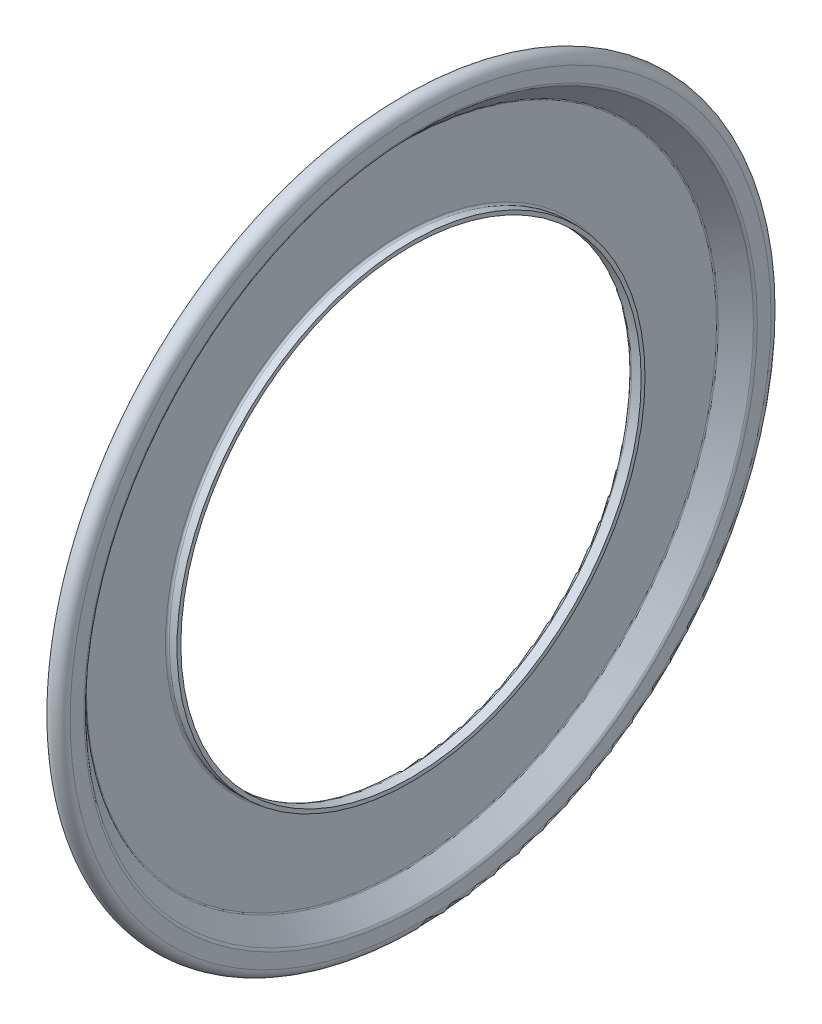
ISO-10303-21;
HEADER;
FILE_DESCRIPTION(('STEP AP214'),'2;1');
FILE_NAME('part.step','',(''),(''),'','','');
FILE_SCHEMA(('AUTOMOTIVE_DESIGN { 1 0 10303 214 1 1 1 1 }'));
ENDSEC;
DATA;
#1=APPLICATION_CONTEXT('core data for automotive mechanical design processes');
#2=APPLICATION_PROTOCOL_DEFINITION('international standard','automotive_design',2000,#1);
#3=PRODUCT_CONTEXT('',#1,'mechanical');
#4=PRODUCT('Part','Part','',(#3));
#5=PRODUCT_RELATED_PRODUCT_CATEGORY('part','',(#4));
#6=PRODUCT_DEFINITION_FORMATION('','',#4);
#7=PRODUCT_DEFINITION_CONTEXT('part definition',#1,'design');
#8=PRODUCT_DEFINITION('design','',#6,#7);
#9=PRODUCT_DEFINITION_SHAPE('','',#8);
#10=(LENGTH_UNIT() NAMED_UNIT(*) SI_UNIT(.MILLI.,.METRE.));
#11=(NAMED_UNIT(*) PLANE_ANGLE_UNIT() SI_UNIT($,.RADIAN.));
#12=(NAMED_UNIT(*) SI_UNIT($,.STERADIAN.) SOLID_ANGLE_UNIT());
#13=UNCERTAINTY_MEASURE_WITH_UNIT(LENGTH_MEASURE(1.E-05),#10,'distance_accuracy_value','');
#14=(GEOMETRIC_REPRESENTATION_CONTEXT(3) GLOBAL_UNCERTAINTY_ASSIGNED_CONTEXT((#13)) GLOBAL_UNIT_ASSIGNED_CONTEXT((#10,
#11,#12)) REPRESENTATION_CONTEXT('',''));
#15=CARTESIAN_POINT('',(0.,0.,0.));
#16=DIRECTION('',(0.,0.,1.));
#17=DIRECTION('',(1.,0.,0.));
#18=AXIS2_PLACEMENT_3D('',#15,#16,#17);
#19=CARTESIAN_POINT('',(0.36,9.8496,0.));
#20=DIRECTION('',(-1.,0.,0.));
#21=DIRECTION('',(0.,0.,1.));
#22=AXIS2_PLACEMENT_3D('',#19,#20,#21);
#23=PLANE('',#22);
#24=CARTESIAN_POINT('',(0.36,0.,0.));
#25=DIRECTION('',(1.,0.,0.));
#26=DIRECTION('',(0.,0.,-1.));
#27=AXIS2_PLACEMENT_3D('',#24,#25,#26);
#28=CIRCLE('',#27,7.2975);
#29=CARTESIAN_POINT('',(0.36,0.,-7.2975));
#30=VERTEX_POINT('',#29);
#31=EDGE_CURVE('E79',#30,#30,#28,.T.);
#32=ORIENTED_EDGE('',*,*,#31,.T.);
#33=EDGE_LOOP('',(#32));
#34=FACE_BOUND('',#33,.T.);
#35=CARTESIAN_POINT('',(0.36,0.,0.));
#36=DIRECTION('',(1.,0.,0.));
#37=DIRECTION('',(0.,0.,-1.));
#38=AXIS2_PLACEMENT_3D('',#35,#36,#37);
#39=CIRCLE('',#38,9.8496);
#40=CARTESIAN_POINT('',(0.36,0.,-9.8496));
#41=VERTEX_POINT('',#40);
#42=EDGE_CURVE('E76',#41,#41,#39,.T.);
#43=ORIENTED_EDGE('',*,*,#42,.F.);
#44=EDGE_LOOP('',(#43));
#45=FACE_BOUND('',#44,.T.);
#46=ADVANCED_FACE('F14',(#34,#45),#23,.T.);
#47=CARTESIAN_POINT('',(0.479999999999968,0.,0.));
#48=DIRECTION('',(1.,0.,0.));
#49=DIRECTION('',(0.,0.,-1.));
#50=AXIS2_PLACEMENT_3D('',#47,#48,#49);
#51=TOROIDAL_SURFACE('',#50,7.2975,0.119999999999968);
#52=CARTESIAN_POINT('',(0.48,0.,0.));
#53=DIRECTION('',(1.,0.,0.));
#54=DIRECTION('',(0.,0.,-1.));
#55=AXIS2_PLACEMENT_3D('',#52,#53,#54);
#56=CIRCLE('',#55,7.1775);
#57=CARTESIAN_POINT('',(0.48,0.,-7.1775));
#58=VERTEX_POINT('',#57);
#59=EDGE_CURVE('E73',#58,#58,#56,.T.);
#60=ORIENTED_EDGE('',*,*,#59,.T.);
#61=EDGE_LOOP('',(#60));
#62=FACE_BOUND('',#61,.T.);
#63=ORIENTED_EDGE('',*,*,#31,.F.);
#64=EDGE_LOOP('',(#63));
#65=FACE_BOUND('',#64,.T.);
#66=ADVANCED_FACE('F85',(#62,#65),#51,.T.);
#67=CARTESIAN_POINT('',(6.,0.,0.));
#68=DIRECTION('',(1.,0.,0.));
#69=DIRECTION('',(0.,0.,-1.));
#70=AXIS2_PLACEMENT_3D('',#67,#68,#69);
#71=CYLINDRICAL_SURFACE('',#70,7.1775);
#72=CARTESIAN_POINT('',(0.78,0.,0.));
#73=DIRECTION('',(1.,0.,0.));
#74=DIRECTION('',(0.,0.,-1.));
#75=AXIS2_PLACEMENT_3D('',#72,#73,#74);
#76=CIRCLE('',#75,7.1775);
#77=CARTESIAN_POINT('',(0.78,0.,-7.1775));
#78=VERTEX_POINT('',#77);
#79=EDGE_CURVE('E70',#78,#78,#76,.T.);
#80=ORIENTED_EDGE('',*,*,#79,.T.);
#81=EDGE_LOOP('',(#80));
#82=FACE_BOUND('',#81,.T.);
#83=ORIENTED_EDGE('',*,*,#59,.F.);
#84=EDGE_LOOP('',(#83));
#85=FACE_BOUND('',#84,.T.);
#86=ADVANCED_FACE('F87',(#82,#85),#71,.F.);
#87=CARTESIAN_POINT('',(0.78,7.1775,0.));
#88=DIRECTION('',(1.,0.,0.));
#89=DIRECTION('',(0.,0.,-1.));
#90=AXIS2_PLACEMENT_3D('',#87,#88,#89);
#91=PLANE('',#90);
#92=CARTESIAN_POINT('',(0.78,0.,0.));
#93=DIRECTION('',(1.,0.,0.));
#94=DIRECTION('',(0.,0.,-1.));
#95=AXIS2_PLACEMENT_3D('',#92,#93,#94);
#96=CIRCLE('',#95,7.2975);
#97=CARTESIAN_POINT('',(0.78,0.,-7.2975));
#98=VERTEX_POINT('',#97);
#99=EDGE_CURVE('E67',#98,#98,#96,.T.);
#100=ORIENTED_EDGE('',*,*,#99,.T.);
#101=EDGE_LOOP('',(#100));
#102=FACE_BOUND('',#101,.T.);
#103=ORIENTED_EDGE('',*,*,#79,.F.);
#104=EDGE_LOOP('',(#103));
#105=FACE_BOUND('',#104,.T.);
#106=ADVANCED_FACE('F95',(#102,#105),#91,.T.);
#107=CARTESIAN_POINT('',(6.,0.,0.));
#108=DIRECTION('',(1.,0.,0.));
#109=DIRECTION('',(0.,0.,-1.));
#110=AXIS2_PLACEMENT_3D('',#107,#108,#109);
#111=CYLINDRICAL_SURFACE('',#110,7.2975);
#112=CARTESIAN_POINT('',(0.54,0.,0.));
#113=DIRECTION('',(1.,0.,0.));
#114=DIRECTION('',(0.,0.,-1.));
#115=AXIS2_PLACEMENT_3D('',#112,#113,#114);
#116=CIRCLE('',#115,7.2975);
#117=CARTESIAN_POINT('',(0.54,0.,-7.2975));
#118=VERTEX_POINT('',#117);
#119=EDGE_CURVE('E64',#118,#118,#116,.T.);
#120=ORIENTED_EDGE('',*,*,#119,.T.);
#121=EDGE_LOOP('',(#120));
#122=FACE_BOUND('',#121,.T.);
#123=ORIENTED_EDGE('',*,*,#99,.F.);
#124=EDGE_LOOP('',(#123));
#125=FACE_BOUND('',#124,.T.);
#126=ADVANCED_FACE('F102',(#122,#125),#111,.T.);
#127=CARTESIAN_POINT('',(0.539999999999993,0.,0.));
#128=DIRECTION('',(1.,0.,0.));
#129=DIRECTION('',(0.,0.,-1.));
#130=AXIS2_PLACEMENT_3D('',#127,#128,#129);
#131=TOROIDAL_SURFACE('',#130,7.3575,0.0599999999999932);
#132=ORIENTED_EDGE('',*,*,#119,.F.);
#133=EDGE_LOOP('',(#132));
#134=FACE_BOUND('',#133,.T.);
#135=CARTESIAN_POINT('',(0.48,0.,0.));
#136=DIRECTION('',(1.,0.,0.));
#137=DIRECTION('',(0.,0.,-1.));
#138=AXIS2_PLACEMENT_3D('',#135,#136,#137);
#139=CIRCLE('',#138,7.35749999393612);
#140=CARTESIAN_POINT('',(0.48,0.,-7.35749999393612));
#141=VERTEX_POINT('',#140);
#142=EDGE_CURVE('E61',#141,#141,#139,.T.);
#143=ORIENTED_EDGE('',*,*,#142,.T.);
#144=EDGE_LOOP('',(#143));
#145=FACE_BOUND('',#144,.T.);
#146=ADVANCED_FACE('F106',(#134,#145),#131,.F.);
#147=CARTESIAN_POINT('',(0.48,7.3575,0.));
#148=DIRECTION('',(1.,0.,0.));
#149=DIRECTION('',(0.,0.,-1.));
#150=AXIS2_PLACEMENT_3D('',#147,#148,#149);
#151=PLANE('',#150);
#152=CARTESIAN_POINT('',(0.48,0.,0.));
#153=DIRECTION('',(1.,0.,0.));
#154=DIRECTION('',(0.,0.,-1.));
#155=AXIS2_PLACEMENT_3D('',#152,#153,#154);
#156=CIRCLE('',#155,9.8247471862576);
#157=CARTESIAN_POINT('',(0.48,0.,-9.8247471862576));
#158=VERTEX_POINT('',#157);
#159=EDGE_CURVE('E58',#158,#158,#156,.T.);
#160=ORIENTED_EDGE('',*,*,#159,.T.);
#161=EDGE_LOOP('',(#160));
#162=FACE_BOUND('',#161,.T.);
#163=ORIENTED_EDGE('',*,*,#142,.F.);
#164=EDGE_LOOP('',(#163));
#165=FACE_BOUND('',#164,.T.);
#166=ADVANCED_FACE('F110',(#162,#165),#151,.T.);
#167=CARTESIAN_POINT('',(0.540000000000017,0.,0.));
#168=DIRECTION('',(1.,0.,0.));
#169=DIRECTION('',(0.,0.,-1.));
#170=AXIS2_PLACEMENT_3D('',#167,#168,#169);
#171=TOROIDAL_SURFACE('',#170,9.8247471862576,0.0600000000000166);
#172=ORIENTED_EDGE('',*,*,#159,.F.);
#173=EDGE_LOOP('',(#172));
#174=FACE_BOUND('',#173,.T.);
#175=CARTESIAN_POINT('',(0.49757359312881,0.,0.));
#176=DIRECTION('',(1.,0.,0.));
#177=DIRECTION('',(0.,0.,-1.));
#178=AXIS2_PLACEMENT_3D('',#175,#176,#177);
#179=CIRCLE('',#178,9.8671735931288);
#180=CARTESIAN_POINT('',(0.49757359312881,0.,-9.8671735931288));
#181=VERTEX_POINT('',#180);
#182=EDGE_CURVE('E55',#181,#181,#179,.T.);
#183=ORIENTED_EDGE('',*,*,#182,.T.);
#184=EDGE_LOOP('',(#183));
#185=FACE_BOUND('',#184,.T.);
#186=ADVANCED_FACE('F114',(#174,#185),#171,.F.);
#187=CARTESIAN_POINT('',(0.49757359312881,0.,0.));
#188=DIRECTION('',(1.,0.,0.));
#189=DIRECTION('',(0.,0.,-1.));
#190=AXIS2_PLACEMENT_3D('',#187,#188,#189);
#191=CONICAL_SURFACE('',#190,9.8671735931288,0.785398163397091);
#192=CARTESIAN_POINT('',(1.0448528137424,0.,0.));
#193=DIRECTION('',(1.,0.,0.));
#194=DIRECTION('',(0.,0.,-1.));
#195=AXIS2_PLACEMENT_3D('',#192,#193,#194);
#196=CIRCLE('',#195,10.414452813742);
#197=CARTESIAN_POINT('',(1.0448528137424,0.,-10.414452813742));
#198=VERTEX_POINT('',#197);
#199=EDGE_CURVE('E52',#198,#198,#196,.T.);
#200=ORIENTED_EDGE('',*,*,#199,.T.);
#201=EDGE_LOOP('',(#200));
#202=FACE_BOUND('',#201,.T.);
#203=ORIENTED_EDGE('',*,*,#182,.F.);
#204=EDGE_LOOP('',(#203));
#205=FACE_BOUND('',#204,.T.);
#206=ADVANCED_FACE('F118',(#202,#205),#191,.F.);
#207=CARTESIAN_POINT('',(0.959999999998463,0.,0.));
#208=DIRECTION('',(1.,0.,0.));
#209=DIRECTION('',(0.,0.,-1.));
#210=AXIS2_PLACEMENT_3D('',#207,#208,#209);
#211=TOROIDAL_SURFACE('',#210,10.499305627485,0.120000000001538);
#212=CARTESIAN_POINT('',(1.08,0.,0.));
#213=DIRECTION('',(1.,0.,0.));
#214=DIRECTION('',(0.,0.,-1.));
#215=AXIS2_PLACEMENT_3D('',#212,#213,#214);
#216=CIRCLE('',#215,10.4993056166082);
#217=CARTESIAN_POINT('',(1.08,0.,-10.4993056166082));
#218=VERTEX_POINT('',#217);
#219=EDGE_CURVE('E49',#218,#218,#216,.T.);
#220=ORIENTED_EDGE('',*,*,#219,.T.);
#221=EDGE_LOOP('',(#220));
#222=FACE_BOUND('',#221,.T.);
#223=ORIENTED_EDGE('',*,*,#199,.F.);
#224=EDGE_LOOP('',(#223));
#225=FACE_BOUND('',#224,.T.);
#226=ADVANCED_FACE('F122',(#222,#225),#211,.T.);
#227=CARTESIAN_POINT('',(1.08,10.499305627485,0.));
#228=DIRECTION('',(1.,0.,0.));
#229=DIRECTION('',(0.,0.,-1.));
#230=AXIS2_PLACEMENT_3D('',#227,#228,#229);
#231=PLANE('',#230);
#232=CARTESIAN_POINT('',(1.08,0.,0.));
#233=DIRECTION('',(1.,0.,0.));
#234=DIRECTION('',(0.,0.,-1.));
#235=AXIS2_PLACEMENT_3D('',#232,#233,#234);
#236=CIRCLE('',#235,10.9296);
#237=CARTESIAN_POINT('',(1.08,0.,-10.9296));
#238=VERTEX_POINT('',#237);
#239=EDGE_CURVE('E46',#238,#238,#236,.T.);
#240=ORIENTED_EDGE('',*,*,#239,.T.);
#241=EDGE_LOOP('',(#240));
#242=FACE_BOUND('',#241,.T.);
#243=ORIENTED_EDGE('',*,*,#219,.F.);
#244=EDGE_LOOP('',(#243));
#245=FACE_BOUND('',#244,.T.);
#246=ADVANCED_FACE('F126',(#242,#245),#231,.T.);
#247=CARTESIAN_POINT('',(0.77999999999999,0.,0.));
#248=DIRECTION('',(1.,0.,0.));
#249=DIRECTION('',(0.,0.,-1.));
#250=AXIS2_PLACEMENT_3D('',#247,#248,#249);
#251=TOROIDAL_SURFACE('',#250,10.9296,0.30000000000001);
#252=CARTESIAN_POINT('',(0.78,0.,0.));
#253=DIRECTION('',(1.,0.,0.));
#254=DIRECTION('',(0.,0.,-1.));
#255=AXIS2_PLACEMENT_3D('',#252,#253,#254);
#256=CIRCLE('',#255,10.6296);
#257=CARTESIAN_POINT('',(0.78,0.,-10.6296));
#258=VERTEX_POINT('',#257);
#259=EDGE_CURVE('E43',#258,#258,#256,.T.);
#260=ORIENTED_EDGE('',*,*,#259,.T.);
#261=EDGE_LOOP('',(#260));
#262=FACE_BOUND('',#261,.T.);
#263=ORIENTED_EDGE('',*,*,#239,.F.);
#264=EDGE_LOOP('',(#263));
#265=FACE_BOUND('',#264,.T.);
#266=ADVANCED_FACE('F130',(#262,#265),#251,.T.);
#267=CARTESIAN_POINT('',(6.,0.,0.));
#268=DIRECTION('',(1.,0.,0.));
#269=DIRECTION('',(0.,0.,-1.));
#270=AXIS2_PLACEMENT_3D('',#267,#268,#269);
#271=CYLINDRICAL_SURFACE('',#270,10.6296);
#272=CARTESIAN_POINT('',(0.84,0.,0.));
#273=DIRECTION('',(1.,0.,0.));
#274=DIRECTION('',(0.,0.,-1.));
#275=AXIS2_PLACEMENT_3D('',#272,#273,#274);
#276=CIRCLE('',#275,10.6296);
#277=CARTESIAN_POINT('',(0.84,0.,-10.6296));
#278=VERTEX_POINT('',#277);
#279=EDGE_CURVE('E40',#278,#278,#276,.T.);
#280=ORIENTED_EDGE('',*,*,#279,.T.);
#281=EDGE_LOOP('',(#280));
#282=FACE_BOUND('',#281,.T.);
#283=ORIENTED_EDGE('',*,*,#259,.F.);
#284=EDGE_LOOP('',(#283));
#285=FACE_BOUND('',#284,.T.);
#286=ADVANCED_FACE('F134',(#282,#285),#271,.F.);
#287=CARTESIAN_POINT('',(0.84,10.6296,0.));
#288=DIRECTION('',(1.,0.,0.));
#289=DIRECTION('',(0.,0.,-1.));
#290=AXIS2_PLACEMENT_3D('',#287,#288,#289);
#291=PLANE('',#290);
#292=CARTESIAN_POINT('',(0.84,0.,0.));
#293=DIRECTION('',(1.,0.,0.));
#294=DIRECTION('',(0.,0.,-1.));
#295=AXIS2_PLACEMENT_3D('',#292,#293,#294);
#296=CIRCLE('',#295,10.7496);
#297=CARTESIAN_POINT('',(0.84,0.,-10.7496));
#298=VERTEX_POINT('',#297);
#299=EDGE_CURVE('E37',#298,#298,#296,.T.);
#300=ORIENTED_EDGE('',*,*,#299,.T.);
#301=EDGE_LOOP('',(#300));
#302=FACE_BOUND('',#301,.T.);
#303=ORIENTED_EDGE('',*,*,#279,.F.);
#304=EDGE_LOOP('',(#303));
#305=FACE_BOUND('',#304,.T.);
#306=ADVANCED_FACE('F138',(#302,#305),#291,.T.);
#307=CARTESIAN_POINT('',(6.,0.,0.));
#308=DIRECTION('',(1.,0.,0.));
#309=DIRECTION('',(0.,0.,-1.));
#310=AXIS2_PLACEMENT_3D('',#307,#308,#309);
#311=CYLINDRICAL_SURFACE('',#310,10.7496);
#312=CARTESIAN_POINT('',(0.78,0.,0.));
#313=DIRECTION('',(1.,0.,0.));
#314=DIRECTION('',(0.,0.,-1.));
#315=AXIS2_PLACEMENT_3D('',#312,#313,#314);
#316=CIRCLE('',#315,10.7496);
#317=CARTESIAN_POINT('',(0.78,0.,-10.7496));
#318=VERTEX_POINT('',#317);
#319=EDGE_CURVE('E34',#318,#318,#316,.T.);
#320=ORIENTED_EDGE('',*,*,#319,.T.);
#321=EDGE_LOOP('',(#320));
#322=FACE_BOUND('',#321,.T.);
#323=ORIENTED_EDGE('',*,*,#299,.F.);
#324=EDGE_LOOP('',(#323));
#325=FACE_BOUND('',#324,.T.);
#326=ADVANCED_FACE('F142',(#322,#325),#311,.T.);
#327=CARTESIAN_POINT('',(0.779999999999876,0.,0.));
#328=DIRECTION('',(1.,0.,0.));
#329=DIRECTION('',(0.,0.,-1.));
#330=AXIS2_PLACEMENT_3D('',#327,#328,#329);
#331=TOROIDAL_SURFACE('',#330,10.9296000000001,0.180000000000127);
#332=ORIENTED_EDGE('',*,*,#319,.F.);
#333=EDGE_LOOP('',(#332));
#334=FACE_BOUND('',#333,.T.);
#335=CARTESIAN_POINT('',(0.96,0.,0.));
#336=DIRECTION('',(1.,0.,0.));
#337=DIRECTION('',(0.,0.,-1.));
#338=AXIS2_PLACEMENT_3D('',#335,#336,#337);
#339=CIRCLE('',#338,10.9295999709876);
#340=CARTESIAN_POINT('',(0.96,0.,-10.9295999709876));
#341=VERTEX_POINT('',#340);
#342=EDGE_CURVE('E29',#341,#341,#339,.T.);
#343=ORIENTED_EDGE('',*,*,#342,.T.);
#344=EDGE_LOOP('',(#343));
#345=FACE_BOUND('',#344,.T.);
#346=ADVANCED_FACE('F146',(#334,#345),#331,.F.);
#347=CARTESIAN_POINT('',(0.96,10.9296,0.));
#348=DIRECTION('',(-1.,0.,0.));
#349=DIRECTION('',(0.,0.,1.));
#350=AXIS2_PLACEMENT_3D('',#347,#348,#349);
#351=PLANE('',#350);
#352=CARTESIAN_POINT('',(0.96,0.,0.));
#353=DIRECTION('',(1.,0.,0.));
#354=DIRECTION('',(0.,0.,-1.));
#355=AXIS2_PLACEMENT_3D('',#352,#353,#354);
#356=CIRCLE('',#355,10.524158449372);
#357=CARTESIAN_POINT('',(0.96,0.,-10.524158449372));
#358=VERTEX_POINT('',#357);
#359=EDGE_CURVE('E25',#358,#358,#356,.T.);
#360=ORIENTED_EDGE('',*,*,#359,.T.);
#361=EDGE_LOOP('',(#360));
#362=FACE_BOUND('',#361,.T.);
#363=ORIENTED_EDGE('',*,*,#342,.F.);
#364=EDGE_LOOP('',(#363));
#365=FACE_BOUND('',#364,.T.);
#366=ADVANCED_FACE('F150',(#362,#365),#351,.T.);
#367=CARTESIAN_POINT('',(0.900000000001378,0.,0.));
#368=DIRECTION('',(1.,0.,0.));
#369=DIRECTION('',(0.,0.,-1.));
#370=AXIS2_PLACEMENT_3D('',#367,#368,#369);
#371=TOROIDAL_SURFACE('',#370,10.5241584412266,0.0599999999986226);
#372=ORIENTED_EDGE('',*,*,#359,.F.);
#373=EDGE_LOOP('',(#372));
#374=FACE_BOUND('',#373,.T.);
#375=CARTESIAN_POINT('',(0.942426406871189,0.,0.));
#376=DIRECTION('',(1.,0.,0.));
#377=DIRECTION('',(0.,0.,-1.));
#378=AXIS2_PLACEMENT_3D('',#375,#376,#377);
#379=CIRCLE('',#378,10.481732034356);
#380=CARTESIAN_POINT('',(0.942426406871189,0.,-10.481732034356));
#381=VERTEX_POINT('',#380);
#382=EDGE_CURVE('E21',#381,#381,#379,.T.);
#383=ORIENTED_EDGE('',*,*,#382,.T.);
#384=EDGE_LOOP('',(#383));
#385=FACE_BOUND('',#384,.T.);
#386=ADVANCED_FACE('F154',(#374,#385),#371,.F.);
#387=CARTESIAN_POINT('',(0.942426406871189,0.,0.));
#388=DIRECTION('',(1.,0.,0.));
#389=DIRECTION('',(0.,0.,-1.));
#390=AXIS2_PLACEMENT_3D('',#387,#388,#389);
#391=CONICAL_SURFACE('',#390,10.481732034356,0.785398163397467);
#392=CARTESIAN_POINT('',(0.395147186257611,0.,0.));
#393=DIRECTION('',(1.,0.,0.));
#394=DIRECTION('',(0.,0.,-1.));
#395=AXIS2_PLACEMENT_3D('',#392,#393,#394);
#396=CIRCLE('',#395,9.9344528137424);
#397=CARTESIAN_POINT('',(0.395147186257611,0.,-9.9344528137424));
#398=VERTEX_POINT('',#397);
#399=EDGE_CURVE('E10',#398,#398,#396,.T.);
#400=ORIENTED_EDGE('',*,*,#399,.T.);
#401=EDGE_LOOP('',(#400));
#402=FACE_BOUND('',#401,.T.);
#403=ORIENTED_EDGE('',*,*,#382,.F.);
#404=EDGE_LOOP('',(#403));
#405=FACE_BOUND('',#404,.T.);
#406=ADVANCED_FACE('F157',(#402,#405),#391,.T.);
#407=CARTESIAN_POINT('',(0.480000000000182,0.,0.));
#408=DIRECTION('',(1.,0.,0.));
#409=DIRECTION('',(0.,0.,-1.));
#410=AXIS2_PLACEMENT_3D('',#407,#408,#409);
#411=TOROIDAL_SURFACE('',#410,9.8496,0.120000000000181);
#412=ORIENTED_EDGE('',*,*,#42,.T.);
#413=EDGE_LOOP('',(#412));
#414=FACE_BOUND('',#413,.T.);
#415=ORIENTED_EDGE('',*,*,#399,.F.);
#416=EDGE_LOOP('',(#415));
#417=FACE_BOUND('',#416,.T.);
#418=ADVANCED_FACE('F16',(#414,#417),#411,.T.);
#419=CLOSED_SHELL('',(#46,#66,#86,#106,#126,#146,#166,#186,#206,#226,#246,#266,#286,#306,#326,
#346,#366,#386,#406,#418));
#420=MANIFOLD_SOLID_BREP('B1',#419);
#421=ADVANCED_BREP_SHAPE_REPRESENTATION('',(#18,#420),#14);
#422=SHAPE_DEFINITION_REPRESENTATION(#9,#421);
ENDSEC;
END-ISO-10303-21;
